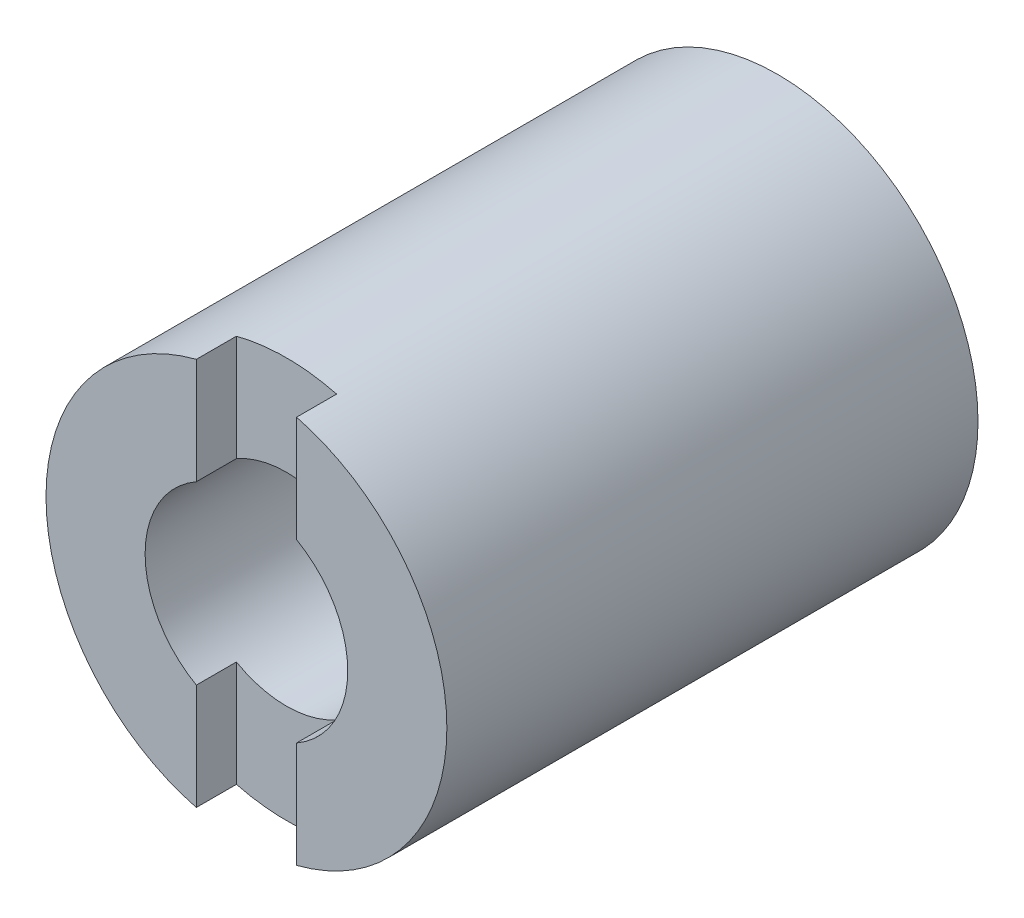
from build123d import *

# Parameters (mm, degrees)
ESQUISSE1_R             = 10
ESQUISSE1_R_2           = 5.055
BASE_EXTRUSION_DEPTH    = 26.5
ESQUISSE2_W             = 5
ESQUISSE2_H             = 22
ENL_V_MAT_EXTRU_1_DEPTH = 2


with BuildPart() as part:
    # Esquisse1 → Base-Extrusion (new body)
    with BuildSketch(Plane.XY):
        Circle(ESQUISSE1_R)
        Circle(ESQUISSE1_R_2, mode=Mode.SUBTRACT)
    extrude(amount=BASE_EXTRUSION_DEPTH)

    # Esquisse2 → Enl_v. mat.-Extru.1 (cut)
    with BuildSketch(Plane.XY.offset(26.5)):
        Rectangle(ESQUISSE2_W, ESQUISSE2_H)
    extrude(amount=-ENL_V_MAT_EXTRU_1_DEPTH, mode=Mode.SUBTRACT)


solid = part.part
